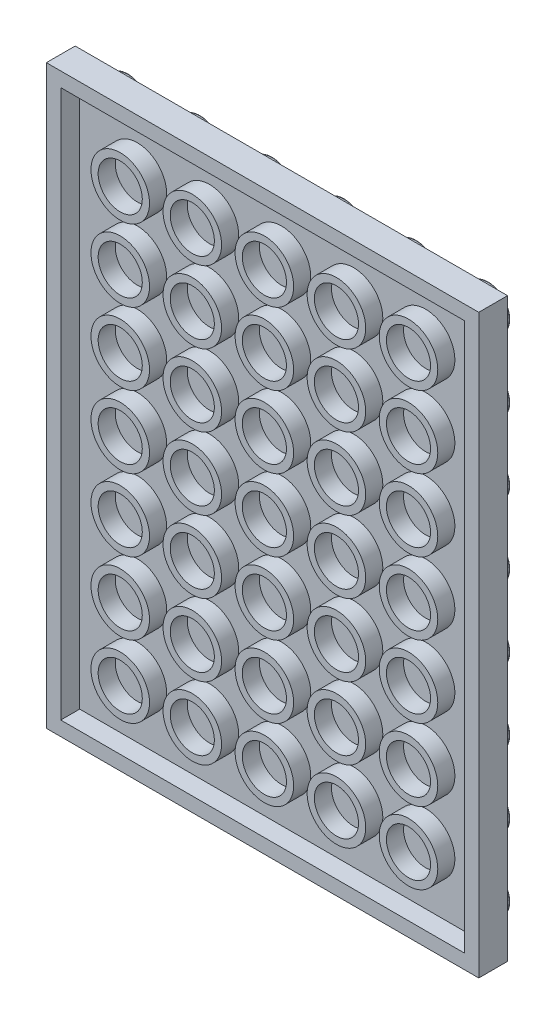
from build123d import *

# Parameters (mm, degrees)
SKIZZE1_W                         = 48
SKIZZE1_H                         = 64
LINEAR_AUSTRAGEN1_DEPTH           = 3.2
SKIZZE2_W                         = 44.8
SKIZZE2_H                         = 60.8
SCHNITT_LINEAR_AUSTRAGEN1_DEPTH   = 2.1
SKIZZE3_R                         = 3.25
SKIZZE3_R_2                       = 2.45
LINEAR_AUSTRAGEN2_DEPTH           = 1.9
SKIZZE4_R                         = 2.45
LINEAR_AUSTRAGEN3_DEPTH           = 1.9
VERRUNDUNG1_R                     = 0.2
LINEARES_MUSTER1_COUNT            = 6
LINEARES_MUSTER1_PITCH            = 8
LINEARES_MUSTER1_COUNT_DIR2       = 8
LINEARES_MUSTER1_PITCH_DIR2       = 8
VERRUNDUNG1_OF_LINEARES_MUSTER1_R = 0.2
LINEARES_MUSTER2_COUNT            = 7
LINEARES_MUSTER2_PITCH            = 8
LINEARES_MUSTER2_COUNT_DIR2       = 5
LINEARES_MUSTER2_PITCH_DIR2       = 8


with BuildPart() as part:
    # Skizze1 → Linear austragen1 (new body)
    with BuildSketch(Plane.XY):
        with Locations((-24, -32)):
            Rectangle(SKIZZE1_W, SKIZZE1_H)
    extrude(amount=LINEAR_AUSTRAGEN1_DEPTH)

    # Skizze2 → Schnitt-Linear austragen1 (cut)
    with BuildSketch(Plane.XY.offset(3.2)):
        with Locations((-24, -32)):
            Rectangle(SKIZZE2_W, SKIZZE2_H)
    extrude(amount=-SCHNITT_LINEAR_AUSTRAGEN1_DEPTH, mode=Mode.SUBTRACT)

    # Skizze3 → Linear austragen2 (add)
    with BuildSketch(Plane.XY.offset(1.1)):
        with Locations(Location((-8, -8, 0), (0, 0, 180))):
            Circle(SKIZZE3_R)
        with Locations(Location((-8, -8, 0), (0, 0, 180))):
            Circle(SKIZZE3_R_2, mode=Mode.SUBTRACT)
    linear_austragen2 = extrude(amount=LINEAR_AUSTRAGEN2_DEPTH)

    # Skizze4 → Linear austragen3 (add)
    with BuildSketch(Plane(origin=(0, 0, 0), x_dir=(-1, 0, 0), z_dir=(0, 0, -1))):
        with Locations(Location((4, -4, 0), (0, 0, 180))):
            Circle(SKIZZE4_R)
    linear_austragen3 = extrude(amount=LINEAR_AUSTRAGEN3_DEPTH)

    # Verrundung1
    verrundung1_edges = [part.edges().sort_by_distance(p)[0] for p in [
        (-6.45, -4, -1.9),
    ]]
    fillet(verrundung1_edges, radius=VERRUNDUNG1_R)

    # Lineares Muster1: Linear austragen3 6 × 8
    with Locations(*[(-i * LINEARES_MUSTER1_PITCH, -j * LINEARES_MUSTER1_PITCH_DIR2, 0) for i in range(LINEARES_MUSTER1_COUNT) for j in range(LINEARES_MUSTER1_COUNT_DIR2) if (i, j) != (0, 0)]):
        add(linear_austragen3)

    # Verrundung1 of Lineares Muster1
    verrundung1_of_lineares_muster1_edges = [part.edges().sort_by_distance(p)[0] for p in [
        (-6.45, -12, -1.9),
        (-6.45, -20, -1.9),
        (-6.45, -28, -1.9),
        (-6.45, -36, -1.9),
        (-6.45, -44, -1.9),
        (-6.45, -52, -1.9),
        (-6.45, -60, -1.9),
        (-14.45, -4, -1.9),
        (-14.45, -12, -1.9),
        (-14.45, -20, -1.9),
        (-14.45, -28, -1.9),
        (-14.45, -36, -1.9),
        (-14.45, -44, -1.9),
        (-14.45, -52, -1.9),
        (-14.45, -60, -1.9),
        (-22.45, -4, -1.9),
        (-22.45, -12, -1.9),
        (-22.45, -20, -1.9),
        (-22.45, -28, -1.9),
        (-22.45, -36, -1.9),
        (-22.45, -44, -1.9),
        (-22.45, -52, -1.9),
        (-22.45, -60, -1.9),
        (-30.45, -4, -1.9),
        (-30.45, -12, -1.9),
        (-30.45, -20, -1.9),
        (-30.45, -28, -1.9),
        (-30.45, -36, -1.9),
        (-30.45, -44, -1.9),
        (-30.45, -52, -1.9),
        (-30.45, -60, -1.9),
        (-38.45, -4, -1.9),
        (-38.45, -12, -1.9),
        (-38.45, -20, -1.9),
        (-38.45, -28, -1.9),
        (-38.45, -36, -1.9),
        (-38.45, -44, -1.9),
        (-38.45, -52, -1.9),
        (-38.45, -60, -1.9),
        (-46.45, -4, -1.9),
        (-46.45, -12, -1.9),
        (-46.45, -20, -1.9),
        (-46.45, -28, -1.9),
        (-46.45, -36, -1.9),
        (-46.45, -44, -1.9),
        (-46.45, -52, -1.9),
        (-46.45, -60, -1.9),
    ]]
    fillet(verrundung1_of_lineares_muster1_edges, radius=VERRUNDUNG1_OF_LINEARES_MUSTER1_R)

    # Lineares Muster2: Linear austragen2 7 × 5
    with Locations(*[(-j * LINEARES_MUSTER2_PITCH_DIR2, -i * LINEARES_MUSTER2_PITCH, 0) for i in range(LINEARES_MUSTER2_COUNT) for j in range(LINEARES_MUSTER2_COUNT_DIR2) if (i, j) != (0, 0)]):
        add(linear_austragen2)


solid = part.part
